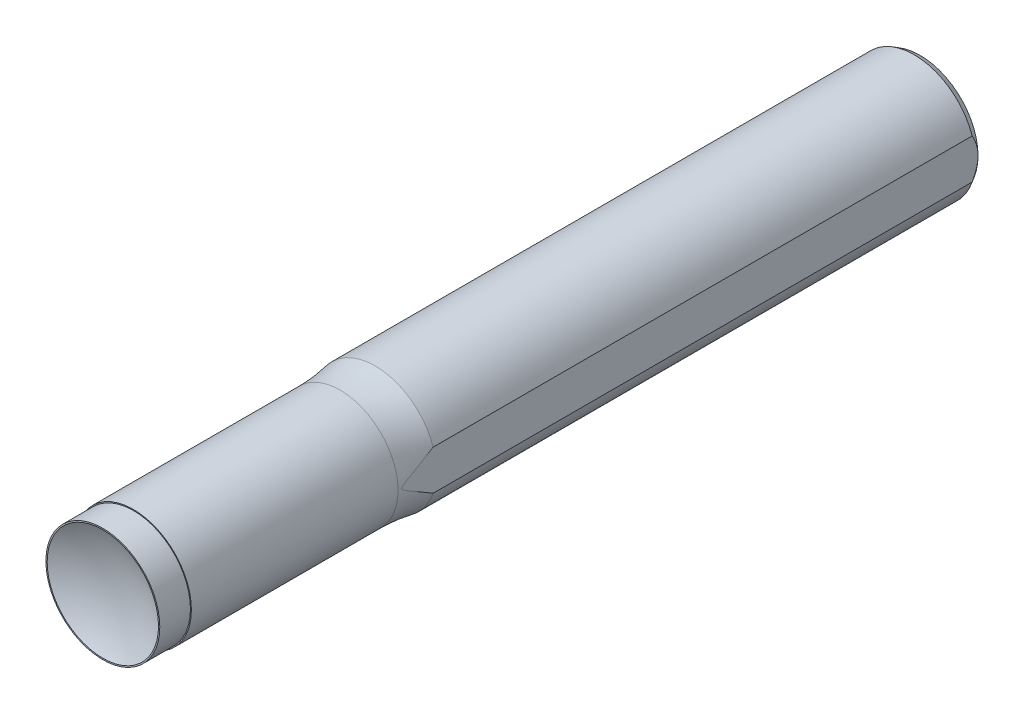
from build123d import *

# Parameters (mm, degrees)
SKETCH1_R           = 9.525
BOSS_EXTRUDE1_DEPTH = 127
SKETCH2_OUTSIDE_W   = 47.016
SKETCH2_OUTSIDE_H   = 47.016
SKETCH2_OUTSIDE_R   = 9
CUT_EXTRUDE1_DEPTH  = 42.333333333
SKETCH3_OUTSIDE_W   = 47.016
SKETCH3_OUTSIDE_H   = 47.016
SKETCH3_OUTSIDE_R   = 8.85
CUT_EXTRUDE2_DEPTH  = 4.7625
CHAMFER1_SIZE       = 0.9
CHAMFER1_SIZE2      = 0.519615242
SKETCH7_W           = 6.206019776
SKETCH7_H           = 6.206019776
CUT_EXTRUDE3_DEPTH  = 128.712377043


with BuildPart() as part:
    # Sketch1 → Boss-Extrude1 (new body)
    with BuildSketch(Plane.XY):
        Circle(SKETCH1_R)
    extrude(amount=-BOSS_EXTRUDE1_DEPTH)

    # Sketch2 outside → Cut-Extrude1 (cut)
    with BuildSketch(Plane.XY):
        Rectangle(SKETCH2_OUTSIDE_W, SKETCH2_OUTSIDE_H)
        Circle(SKETCH2_OUTSIDE_R, mode=Mode.SUBTRACT)
    extrude(amount=-CUT_EXTRUDE1_DEPTH, mode=Mode.SUBTRACT)

    # Sketch3 outside → Cut-Extrude2 (cut)
    with BuildSketch(Plane.XY):
        Rectangle(SKETCH3_OUTSIDE_W, SKETCH3_OUTSIDE_H)
        Circle(SKETCH3_OUTSIDE_R, mode=Mode.SUBTRACT)
    extrude(amount=-CUT_EXTRUDE2_DEPTH, mode=Mode.SUBTRACT)

    # Sketch4 → Cut-Revolve1 (revolve, cut)
    with BuildSketch(Plane(origin=(0, 0, 0), x_dir=(0, 0, -1), z_dir=(1, 0, 0))):
        with BuildLine():
            Line((0, 0), (0, 8.65))
            ThreePointArc((0, 8.65), (1.550533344, 4.447942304), (2.077080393, 0))
            Line((2.077080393, 0), (0, 0))
        make_face()
    revolve(axis=Axis((0, 0, 0), (0, 0, -1)), mode=Mode.SUBTRACT)

    # Chamfer1
    chamfer1_edges = [part.edges().sort_by_distance(p)[0] for p in [
        (-9.525, 0, -127),
    ]]
    chamfer1_side = [part.faces().sort_by_distance(p)[0] for p in [
        (-9.525, 0, -84.666666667),
    ]]
    chamfer(chamfer1_edges, length=CHAMFER1_SIZE, length2=CHAMFER1_SIZE2, reference=chamfer1_side[0])

    # Sketch5 → Revolve1 (revolve)
    with BuildSketch(Plane(origin=(0, 0, 0), x_dir=(0, 0, -1), z_dir=(1, 0, 0)), mode=Mode.PRIVATE) as revolve1_sk:
        with BuildLine():
            Line((42.333333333, 0), (36.880982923, 0))
            Line((36.880982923, 0), (36.880982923, 9))
            ThreePointArc((36.880982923, 9), (39.619766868, 9.13155282), (42.333333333, 9.525))
            Line((42.333333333, 9.525), (42.333333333, 0))
        make_face()
    revolve(revolve1_sk.sketch.rotate(Axis((0, 0, -42.333333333), (0, 0, 1)), 270), axis=Axis((0, 0, -42.333333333), (0, 0, 1)))

    # Sketch7 → Cut-Extrude3 (cut, through all)
    with BuildSketch(Plane(origin=(0, 0, -127), x_dir=(-1, 0, 0), z_dir=(0, 0, -1))):
        with Locations((-12.108394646, 0)):
            Rectangle(SKETCH7_W, SKETCH7_H)
    extrude(amount=-CUT_EXTRUDE3_DEPTH, mode=Mode.SUBTRACT)


solid = part.part
